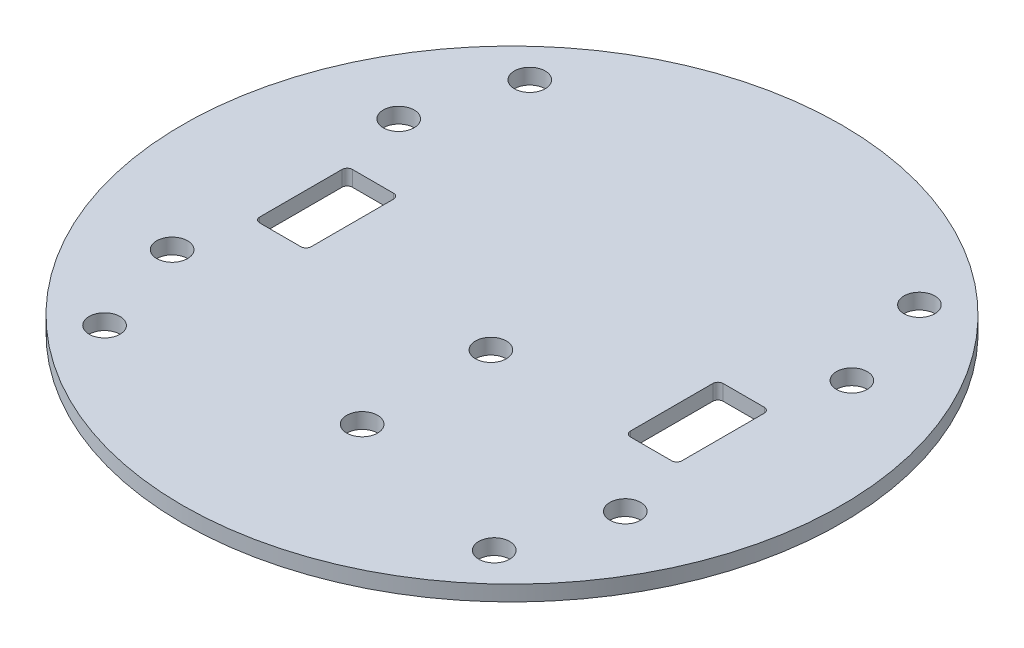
ISO-10303-21;
HEADER;
FILE_DESCRIPTION(('STEP AP214'),'2;1');
FILE_NAME('part.step','',(''),(''),'','','');
FILE_SCHEMA(('AUTOMOTIVE_DESIGN { 1 0 10303 214 1 1 1 1 }'));
ENDSEC;
DATA;
#1=APPLICATION_CONTEXT('core data for automotive mechanical design processes');
#2=APPLICATION_PROTOCOL_DEFINITION('international standard','automotive_design',2000,#1);
#3=PRODUCT_CONTEXT('',#1,'mechanical');
#4=PRODUCT('Part','Part','',(#3));
#5=PRODUCT_RELATED_PRODUCT_CATEGORY('part','',(#4));
#6=PRODUCT_DEFINITION_FORMATION('','',#4);
#7=PRODUCT_DEFINITION_CONTEXT('part definition',#1,'design');
#8=PRODUCT_DEFINITION('design','',#6,#7);
#9=PRODUCT_DEFINITION_SHAPE('','',#8);
#10=(LENGTH_UNIT() NAMED_UNIT(*) SI_UNIT(.MILLI.,.METRE.));
#11=(NAMED_UNIT(*) PLANE_ANGLE_UNIT() SI_UNIT($,.RADIAN.));
#12=(NAMED_UNIT(*) SI_UNIT($,.STERADIAN.) SOLID_ANGLE_UNIT());
#13=UNCERTAINTY_MEASURE_WITH_UNIT(LENGTH_MEASURE(1.E-05),#10,'distance_accuracy_value','');
#14=(GEOMETRIC_REPRESENTATION_CONTEXT(3) GLOBAL_UNCERTAINTY_ASSIGNED_CONTEXT((#13)) GLOBAL_UNIT_ASSIGNED_CONTEXT((#10,
#11,#12)) REPRESENTATION_CONTEXT('',''));
#15=CARTESIAN_POINT('',(0.,0.,0.));
#16=DIRECTION('',(0.,0.,1.));
#17=DIRECTION('',(1.,0.,0.));
#18=AXIS2_PLACEMENT_3D('',#15,#16,#17);
#19=CARTESIAN_POINT('',(0.,-1.5,0.));
#20=DIRECTION('',(0.,1.,0.));
#21=DIRECTION('',(0.,0.,1.));
#22=AXIS2_PLACEMENT_3D('',#19,#20,#21);
#23=CYLINDRICAL_SURFACE('',#22,32.);
#24=CARTESIAN_POINT('',(0.,-1.5,0.));
#25=DIRECTION('',(0.,1.,0.));
#26=DIRECTION('',(0.,0.,1.));
#27=AXIS2_PLACEMENT_3D('',#24,#25,#26);
#28=CIRCLE('',#27,32.);
#29=CARTESIAN_POINT('',(0.,-1.5,32.));
#30=VERTEX_POINT('',#29);
#31=EDGE_CURVE('E299',#30,#30,#28,.T.);
#32=ORIENTED_EDGE('',*,*,#31,.T.);
#33=EDGE_LOOP('',(#32));
#34=FACE_BOUND('',#33,.T.);
#35=CARTESIAN_POINT('',(0.,0.,0.));
#36=DIRECTION('',(0.,1.,0.));
#37=DIRECTION('',(0.,0.,1.));
#38=AXIS2_PLACEMENT_3D('',#35,#36,#37);
#39=CIRCLE('',#38,32.);
#40=CARTESIAN_POINT('',(0.,0.,32.));
#41=VERTEX_POINT('',#40);
#42=EDGE_CURVE('E295',#41,#41,#39,.T.);
#43=ORIENTED_EDGE('',*,*,#42,.F.);
#44=EDGE_LOOP('',(#43));
#45=FACE_BOUND('',#44,.T.);
#46=ADVANCED_FACE('F46',(#34,#45),#23,.T.);
#47=CARTESIAN_POINT('',(0.,-1.5,0.));
#48=DIRECTION('',(0.,1.,0.));
#49=DIRECTION('',(0.,0.,1.));
#50=AXIS2_PLACEMENT_3D('',#47,#48,#49);
#51=PLANE('',#50);
#52=DIRECTION('',(0.,0.,-1.));
#53=VECTOR('',#52,1.);
#54=CARTESIAN_POINT('',(-15.5,-1.5,-4.5));
#55=LINE('',#54,#53);
#56=CARTESIAN_POINT('',(-15.5,-1.5,3.99999999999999));
#57=VERTEX_POINT('',#56);
#58=CARTESIAN_POINT('',(-15.5,-1.5,-4.));
#59=VERTEX_POINT('',#58);
#60=EDGE_CURVE('E414',#57,#59,#55,.T.);
#61=ORIENTED_EDGE('',*,*,#60,.T.);
#62=CARTESIAN_POINT('',(-16.,-1.5,-4.));
#63=DIRECTION('',(0.,1.,0.));
#64=DIRECTION('',(0.,0.,1.));
#65=AXIS2_PLACEMENT_3D('',#62,#63,#64);
#66=CIRCLE('',#65,0.5);
#67=CARTESIAN_POINT('',(-16.,-1.5,-4.5));
#68=VERTEX_POINT('',#67);
#69=EDGE_CURVE('E382',#59,#68,#66,.T.);
#70=ORIENTED_EDGE('',*,*,#69,.T.);
#71=DIRECTION('',(-1.,0.,0.));
#72=VECTOR('',#71,1.);
#73=CARTESIAN_POINT('',(-20.5,-1.5,-4.5));
#74=LINE('',#73,#72);
#75=CARTESIAN_POINT('',(-20.,-1.5,-4.5));
#76=VERTEX_POINT('',#75);
#77=EDGE_CURVE('E222',#68,#76,#74,.T.);
#78=ORIENTED_EDGE('',*,*,#77,.T.);
#79=CARTESIAN_POINT('',(-20.,-1.5,-4.));
#80=DIRECTION('',(0.,1.,0.));
#81=DIRECTION('',(0.,0.,1.));
#82=AXIS2_PLACEMENT_3D('',#79,#80,#81);
#83=CIRCLE('',#82,0.5);
#84=CARTESIAN_POINT('',(-20.5,-1.5,-4.));
#85=VERTEX_POINT('',#84);
#86=EDGE_CURVE('E11',#76,#85,#83,.T.);
#87=ORIENTED_EDGE('',*,*,#86,.T.);
#88=DIRECTION('',(0.,0.,1.));
#89=VECTOR('',#88,1.);
#90=CARTESIAN_POINT('',(-20.5,-1.5,-4.5));
#91=LINE('',#90,#89);
#92=CARTESIAN_POINT('',(-20.5,-1.5,3.99999999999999));
#93=VERTEX_POINT('',#92);
#94=EDGE_CURVE('E404',#85,#93,#91,.T.);
#95=ORIENTED_EDGE('',*,*,#94,.T.);
#96=CARTESIAN_POINT('',(-20.,-1.5,3.99999999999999));
#97=DIRECTION('',(0.,1.,0.));
#98=DIRECTION('',(0.,0.,1.));
#99=AXIS2_PLACEMENT_3D('',#96,#97,#98);
#100=CIRCLE('',#99,0.5);
#101=CARTESIAN_POINT('',(-20.,-1.5,4.5));
#102=VERTEX_POINT('',#101);
#103=EDGE_CURVE('E388',#93,#102,#100,.T.);
#104=ORIENTED_EDGE('',*,*,#103,.T.);
#105=DIRECTION('',(1.,0.,0.));
#106=VECTOR('',#105,1.);
#107=CARTESIAN_POINT('',(-20.5,-1.5,4.5));
#108=LINE('',#107,#106);
#109=CARTESIAN_POINT('',(-16.,-1.5,4.5));
#110=VERTEX_POINT('',#109);
#111=EDGE_CURVE('E410',#102,#110,#108,.T.);
#112=ORIENTED_EDGE('',*,*,#111,.T.);
#113=CARTESIAN_POINT('',(-16.,-1.5,3.99999999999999));
#114=DIRECTION('',(0.,1.,0.));
#115=DIRECTION('',(0.,0.,1.));
#116=AXIS2_PLACEMENT_3D('',#113,#114,#115);
#117=CIRCLE('',#116,0.5);
#118=EDGE_CURVE('E376',#110,#57,#117,.T.);
#119=ORIENTED_EDGE('',*,*,#118,.T.);
#120=EDGE_LOOP('',(#61,#70,#78,#87,#95,#104,#112,#119));
#121=FACE_BOUND('',#120,.T.);
#122=DIRECTION('',(1.,0.,0.));
#123=VECTOR('',#122,1.);
#124=CARTESIAN_POINT('',(20.5,-1.5,4.5));
#125=LINE('',#124,#123);
#126=CARTESIAN_POINT('',(16.,-1.5,4.5));
#127=VERTEX_POINT('',#126);
#128=CARTESIAN_POINT('',(20.,-1.5,4.5));
#129=VERTEX_POINT('',#128);
#130=EDGE_CURVE('E206',#127,#129,#125,.T.);
#131=ORIENTED_EDGE('',*,*,#130,.T.);
#132=CARTESIAN_POINT('',(20.,-1.5,3.99999999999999));
#133=DIRECTION('',(0.,1.,0.));
#134=DIRECTION('',(0.,0.,1.));
#135=AXIS2_PLACEMENT_3D('',#132,#133,#134);
#136=CIRCLE('',#135,0.5);
#137=CARTESIAN_POINT('',(20.5,-1.5,3.99999999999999));
#138=VERTEX_POINT('',#137);
#139=EDGE_CURVE('E370',#129,#138,#136,.T.);
#140=ORIENTED_EDGE('',*,*,#139,.T.);
#141=DIRECTION('',(0.,0.,-1.));
#142=VECTOR('',#141,1.);
#143=CARTESIAN_POINT('',(20.5,-1.5,-4.5));
#144=LINE('',#143,#142);
#145=CARTESIAN_POINT('',(20.5,-1.5,-4.));
#146=VERTEX_POINT('',#145);
#147=EDGE_CURVE('E202',#138,#146,#144,.T.);
#148=ORIENTED_EDGE('',*,*,#147,.T.);
#149=CARTESIAN_POINT('',(20.,-1.5,-4.));
#150=DIRECTION('',(0.,1.,0.));
#151=DIRECTION('',(0.,0.,1.));
#152=AXIS2_PLACEMENT_3D('',#149,#150,#151);
#153=CIRCLE('',#152,0.5);
#154=CARTESIAN_POINT('',(20.,-1.5,-4.5));
#155=VERTEX_POINT('',#154);
#156=EDGE_CURVE('E171',#146,#155,#153,.T.);
#157=ORIENTED_EDGE('',*,*,#156,.T.);
#158=DIRECTION('',(-1.,0.,0.));
#159=VECTOR('',#158,1.);
#160=CARTESIAN_POINT('',(20.5,-1.5,-4.5));
#161=LINE('',#160,#159);
#162=CARTESIAN_POINT('',(16.,-1.5,-4.5));
#163=VERTEX_POINT('',#162);
#164=EDGE_CURVE('E180',#155,#163,#161,.T.);
#165=ORIENTED_EDGE('',*,*,#164,.T.);
#166=CARTESIAN_POINT('',(16.,-1.5,-4.));
#167=DIRECTION('',(0.,1.,0.));
#168=DIRECTION('',(0.,0.,1.));
#169=AXIS2_PLACEMENT_3D('',#166,#167,#168);
#170=CIRCLE('',#169,0.5);
#171=CARTESIAN_POINT('',(15.5,-1.5,-4.));
#172=VERTEX_POINT('',#171);
#173=EDGE_CURVE('E358',#163,#172,#170,.T.);
#174=ORIENTED_EDGE('',*,*,#173,.T.);
#175=DIRECTION('',(0.,0.,1.));
#176=VECTOR('',#175,1.);
#177=CARTESIAN_POINT('',(15.5,-1.5,-4.5));
#178=LINE('',#177,#176);
#179=CARTESIAN_POINT('',(15.5,-1.5,3.99999999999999));
#180=VERTEX_POINT('',#179);
#181=EDGE_CURVE('E210',#172,#180,#178,.T.);
#182=ORIENTED_EDGE('',*,*,#181,.T.);
#183=CARTESIAN_POINT('',(16.,-1.5,3.99999999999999));
#184=DIRECTION('',(0.,1.,0.));
#185=DIRECTION('',(0.,0.,1.));
#186=AXIS2_PLACEMENT_3D('',#183,#184,#185);
#187=CIRCLE('',#186,0.5);
#188=EDGE_CURVE('E364',#180,#127,#187,.T.);
#189=ORIENTED_EDGE('',*,*,#188,.T.);
#190=EDGE_LOOP('',(#131,#140,#148,#157,#165,#174,#182,#189));
#191=FACE_BOUND('',#190,.T.);
#192=CARTESIAN_POINT('',(1.90000000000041,-1.5,3.94999999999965));
#193=DIRECTION('',(0.,1.,0.));
#194=DIRECTION('',(0.,0.,1.));
#195=AXIS2_PLACEMENT_3D('',#192,#193,#194);
#196=CIRCLE('',#195,1.49999999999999);
#197=CARTESIAN_POINT('',(1.90000000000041,-1.5,5.44999999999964));
#198=VERTEX_POINT('',#197);
#199=EDGE_CURVE('E221',#198,#198,#196,.T.);
#200=ORIENTED_EDGE('',*,*,#199,.T.);
#201=EDGE_LOOP('',(#200));
#202=FACE_BOUND('',#201,.T.);
#203=CARTESIAN_POINT('',(1.90000000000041,-1.5,16.4499999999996));
#204=DIRECTION('',(0.,1.,0.));
#205=DIRECTION('',(0.,0.,1.));
#206=AXIS2_PLACEMENT_3D('',#203,#204,#205);
#207=CIRCLE('',#206,1.49999999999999);
#208=CARTESIAN_POINT('',(1.90000000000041,-1.5,17.9499999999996));
#209=VERTEX_POINT('',#208);
#210=EDGE_CURVE('E230',#209,#209,#207,.T.);
#211=ORIENTED_EDGE('',*,*,#210,.T.);
#212=EDGE_LOOP('',(#211));
#213=FACE_BOUND('',#212,.T.);
#214=CARTESIAN_POINT('',(-22.,-1.5,-11.));
#215=DIRECTION('',(0.,1.,0.));
#216=DIRECTION('',(0.,0.,1.));
#217=AXIS2_PLACEMENT_3D('',#214,#215,#216);
#218=CIRCLE('',#217,1.5);
#219=CARTESIAN_POINT('',(-22.,-1.5,-9.50000000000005));
#220=VERTEX_POINT('',#219);
#221=EDGE_CURVE('E238',#220,#220,#218,.T.);
#222=ORIENTED_EDGE('',*,*,#221,.T.);
#223=EDGE_LOOP('',(#222));
#224=FACE_BOUND('',#223,.T.);
#225=CARTESIAN_POINT('',(21.999999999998,-1.5,-11.));
#226=DIRECTION('',(0.,1.,0.));
#227=DIRECTION('',(0.,0.,1.));
#228=AXIS2_PLACEMENT_3D('',#225,#226,#227);
#229=CIRCLE('',#228,1.5);
#230=CARTESIAN_POINT('',(21.999999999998,-1.5,-9.5));
#231=VERTEX_POINT('',#230);
#232=EDGE_CURVE('E246',#231,#231,#229,.T.);
#233=ORIENTED_EDGE('',*,*,#232,.T.);
#234=EDGE_LOOP('',(#233));
#235=FACE_BOUND('',#234,.T.);
#236=CARTESIAN_POINT('',(21.999999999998,-1.5,11.));
#237=DIRECTION('',(0.,1.,0.));
#238=DIRECTION('',(0.,0.,1.));
#239=AXIS2_PLACEMENT_3D('',#236,#237,#238);
#240=CIRCLE('',#239,1.5);
#241=CARTESIAN_POINT('',(21.999999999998,-1.5,12.5));
#242=VERTEX_POINT('',#241);
#243=EDGE_CURVE('E254',#242,#242,#240,.T.);
#244=ORIENTED_EDGE('',*,*,#243,.T.);
#245=EDGE_LOOP('',(#244));
#246=FACE_BOUND('',#245,.T.);
#247=CARTESIAN_POINT('',(-22.,-1.5,11.));
#248=DIRECTION('',(0.,1.,0.));
#249=DIRECTION('',(0.,0.,1.));
#250=AXIS2_PLACEMENT_3D('',#247,#248,#249);
#251=CIRCLE('',#250,1.5);
#252=CARTESIAN_POINT('',(-22.,-1.5,12.4999999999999));
#253=VERTEX_POINT('',#252);
#254=EDGE_CURVE('E262',#253,#253,#251,.T.);
#255=ORIENTED_EDGE('',*,*,#254,.T.);
#256=EDGE_LOOP('',(#255));
#257=FACE_BOUND('',#256,.T.);
#258=CARTESIAN_POINT('',(-18.9165258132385,-1.5,20.6437654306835));
#259=DIRECTION('',(0.,1.,0.));
#260=DIRECTION('',(0.,0.,-1.));
#261=AXIS2_PLACEMENT_3D('',#258,#259,#260);
#262=CIRCLE('',#261,1.5);
#263=CARTESIAN_POINT('',(-18.9165258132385,-1.5,19.1437654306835));
#264=VERTEX_POINT('',#263);
#265=EDGE_CURVE('E266',#264,#264,#262,.T.);
#266=ORIENTED_EDGE('',*,*,#265,.T.);
#267=EDGE_LOOP('',(#266));
#268=FACE_BOUND('',#267,.T.);
#269=CARTESIAN_POINT('',(18.9165258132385,-1.5,20.6437654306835));
#270=DIRECTION('',(0.,1.,0.));
#271=DIRECTION('',(0.,0.,-1.));
#272=AXIS2_PLACEMENT_3D('',#269,#270,#271);
#273=CIRCLE('',#272,1.5);
#274=CARTESIAN_POINT('',(18.9165258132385,-1.5,19.1437654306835));
#275=VERTEX_POINT('',#274);
#276=EDGE_CURVE('E280',#275,#275,#273,.T.);
#277=ORIENTED_EDGE('',*,*,#276,.T.);
#278=EDGE_LOOP('',(#277));
#279=FACE_BOUND('',#278,.T.);
#280=CARTESIAN_POINT('',(18.9165258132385,-1.5,-20.6437654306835));
#281=DIRECTION('',(0.,1.,0.));
#282=DIRECTION('',(0.,0.,1.));
#283=AXIS2_PLACEMENT_3D('',#280,#281,#282);
#284=CIRCLE('',#283,1.5);
#285=CARTESIAN_POINT('',(18.9165258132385,-1.5,-19.1437654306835));
#286=VERTEX_POINT('',#285);
#287=EDGE_CURVE('E272',#286,#286,#284,.T.);
#288=ORIENTED_EDGE('',*,*,#287,.T.);
#289=EDGE_LOOP('',(#288));
#290=FACE_BOUND('',#289,.T.);
#291=CARTESIAN_POINT('',(-18.9165258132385,-1.5,-20.6437654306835));
#292=DIRECTION('',(0.,1.,0.));
#293=DIRECTION('',(0.,0.,1.));
#294=AXIS2_PLACEMENT_3D('',#291,#292,#293);
#295=CIRCLE('',#294,1.5);
#296=CARTESIAN_POINT('',(-18.9165258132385,-1.5,-19.1437654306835));
#297=VERTEX_POINT('',#296);
#298=EDGE_CURVE('E291',#297,#297,#295,.T.);
#299=ORIENTED_EDGE('',*,*,#298,.T.);
#300=EDGE_LOOP('',(#299));
#301=FACE_BOUND('',#300,.T.);
#302=ORIENTED_EDGE('',*,*,#31,.F.);
#303=EDGE_LOOP('',(#302));
#304=FACE_BOUND('',#303,.T.);
#305=ADVANCED_FACE('F443',(#121,#191,#202,#213,#224,#235,#246,#257,#268,#279,#290,#301,#304),
#51,.F.);
#306=CARTESIAN_POINT('',(0.,0.,0.));
#307=DIRECTION('',(0.,1.,0.));
#308=DIRECTION('',(0.,0.,1.));
#309=AXIS2_PLACEMENT_3D('',#306,#307,#308);
#310=PLANE('',#309);
#311=DIRECTION('',(0.,0.,1.));
#312=VECTOR('',#311,1.);
#313=CARTESIAN_POINT('',(-20.5,0.,-4.5));
#314=LINE('',#313,#312);
#315=CARTESIAN_POINT('',(-20.5,0.,-4.));
#316=VERTEX_POINT('',#315);
#317=CARTESIAN_POINT('',(-20.5,0.,3.99999999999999));
#318=VERTEX_POINT('',#317);
#319=EDGE_CURVE('E190',#316,#318,#314,.T.);
#320=ORIENTED_EDGE('',*,*,#319,.F.);
#321=CARTESIAN_POINT('',(-20.,0.,-4.));
#322=DIRECTION('',(0.,1.,0.));
#323=DIRECTION('',(0.,0.,1.));
#324=AXIS2_PLACEMENT_3D('',#321,#322,#323);
#325=CIRCLE('',#324,0.5);
#326=CARTESIAN_POINT('',(-20.,0.,-4.5));
#327=VERTEX_POINT('',#326);
#328=EDGE_CURVE('E55',#316,#327,#325,.F.);
#329=ORIENTED_EDGE('',*,*,#328,.T.);
#330=DIRECTION('',(-1.,0.,0.));
#331=VECTOR('',#330,1.);
#332=CARTESIAN_POINT('',(-20.5,0.,-4.5));
#333=LINE('',#332,#331);
#334=CARTESIAN_POINT('',(-16.,0.,-4.5));
#335=VERTEX_POINT('',#334);
#336=EDGE_CURVE('E395',#335,#327,#333,.T.);
#337=ORIENTED_EDGE('',*,*,#336,.F.);
#338=CARTESIAN_POINT('',(-16.,0.,-4.));
#339=DIRECTION('',(0.,1.,0.));
#340=DIRECTION('',(0.,0.,1.));
#341=AXIS2_PLACEMENT_3D('',#338,#339,#340);
#342=CIRCLE('',#341,0.5);
#343=CARTESIAN_POINT('',(-15.5,0.,-4.));
#344=VERTEX_POINT('',#343);
#345=EDGE_CURVE('E379',#335,#344,#342,.F.);
#346=ORIENTED_EDGE('',*,*,#345,.T.);
#347=DIRECTION('',(0.,0.,-1.));
#348=VECTOR('',#347,1.);
#349=CARTESIAN_POINT('',(-15.5,0.,-4.5));
#350=LINE('',#349,#348);
#351=CARTESIAN_POINT('',(-15.5,0.,3.99999999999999));
#352=VERTEX_POINT('',#351);
#353=EDGE_CURVE('E405',#352,#344,#350,.T.);
#354=ORIENTED_EDGE('',*,*,#353,.F.);
#355=CARTESIAN_POINT('',(-16.,0.,3.99999999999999));
#356=DIRECTION('',(0.,1.,0.));
#357=DIRECTION('',(0.,0.,1.));
#358=AXIS2_PLACEMENT_3D('',#355,#356,#357);
#359=CIRCLE('',#358,0.5);
#360=CARTESIAN_POINT('',(-16.,0.,4.5));
#361=VERTEX_POINT('',#360);
#362=EDGE_CURVE('E373',#352,#361,#359,.F.);
#363=ORIENTED_EDGE('',*,*,#362,.T.);
#364=DIRECTION('',(1.,0.,0.));
#365=VECTOR('',#364,1.);
#366=CARTESIAN_POINT('',(-20.5,0.,4.5));
#367=LINE('',#366,#365);
#368=CARTESIAN_POINT('',(-20.,0.,4.5));
#369=VERTEX_POINT('',#368);
#370=EDGE_CURVE('E195',#369,#361,#367,.T.);
#371=ORIENTED_EDGE('',*,*,#370,.F.);
#372=CARTESIAN_POINT('',(-20.,0.,3.99999999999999));
#373=DIRECTION('',(0.,1.,0.));
#374=DIRECTION('',(0.,0.,1.));
#375=AXIS2_PLACEMENT_3D('',#372,#373,#374);
#376=CIRCLE('',#375,0.5);
#377=EDGE_CURVE('E385',#369,#318,#376,.F.);
#378=ORIENTED_EDGE('',*,*,#377,.T.);
#379=EDGE_LOOP('',(#320,#329,#337,#346,#354,#363,#371,#378));
#380=FACE_BOUND('',#379,.T.);
#381=DIRECTION('',(-1.,0.,0.));
#382=VECTOR('',#381,1.);
#383=CARTESIAN_POINT('',(20.5,0.,-4.5));
#384=LINE('',#383,#382);
#385=CARTESIAN_POINT('',(20.,0.,-4.5));
#386=VERTEX_POINT('',#385);
#387=CARTESIAN_POINT('',(16.,0.,-4.5));
#388=VERTEX_POINT('',#387);
#389=EDGE_CURVE('E177',#386,#388,#384,.T.);
#390=ORIENTED_EDGE('',*,*,#389,.F.);
#391=CARTESIAN_POINT('',(20.,0.,-4.));
#392=DIRECTION('',(0.,1.,0.));
#393=DIRECTION('',(0.,0.,1.));
#394=AXIS2_PLACEMENT_3D('',#391,#392,#393);
#395=CIRCLE('',#394,0.5);
#396=CARTESIAN_POINT('',(20.5,0.,-4.));
#397=VERTEX_POINT('',#396);
#398=EDGE_CURVE('E160',#386,#397,#395,.F.);
#399=ORIENTED_EDGE('',*,*,#398,.T.);
#400=DIRECTION('',(0.,0.,-1.));
#401=VECTOR('',#400,1.);
#402=CARTESIAN_POINT('',(20.5,0.,-4.5));
#403=LINE('',#402,#401);
#404=CARTESIAN_POINT('',(20.5,0.,3.99999999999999));
#405=VERTEX_POINT('',#404);
#406=EDGE_CURVE('E216',#405,#397,#403,.T.);
#407=ORIENTED_EDGE('',*,*,#406,.F.);
#408=CARTESIAN_POINT('',(20.,0.,3.99999999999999));
#409=DIRECTION('',(0.,1.,0.));
#410=DIRECTION('',(0.,0.,1.));
#411=AXIS2_PLACEMENT_3D('',#408,#409,#410);
#412=CIRCLE('',#411,0.5);
#413=CARTESIAN_POINT('',(20.,0.,4.5));
#414=VERTEX_POINT('',#413);
#415=EDGE_CURVE('E367',#405,#414,#412,.F.);
#416=ORIENTED_EDGE('',*,*,#415,.T.);
#417=DIRECTION('',(1.,0.,0.));
#418=VECTOR('',#417,1.);
#419=CARTESIAN_POINT('',(20.5,0.,4.5));
#420=LINE('',#419,#418);
#421=CARTESIAN_POINT('',(16.,0.,4.5));
#422=VERTEX_POINT('',#421);
#423=EDGE_CURVE('E198',#422,#414,#420,.T.);
#424=ORIENTED_EDGE('',*,*,#423,.F.);
#425=CARTESIAN_POINT('',(16.,0.,3.99999999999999));
#426=DIRECTION('',(0.,1.,0.));
#427=DIRECTION('',(0.,0.,1.));
#428=AXIS2_PLACEMENT_3D('',#425,#426,#427);
#429=CIRCLE('',#428,0.5);
#430=CARTESIAN_POINT('',(15.5,0.,3.99999999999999));
#431=VERTEX_POINT('',#430);
#432=EDGE_CURVE('E361',#422,#431,#429,.F.);
#433=ORIENTED_EDGE('',*,*,#432,.T.);
#434=DIRECTION('',(0.,0.,1.));
#435=VECTOR('',#434,1.);
#436=CARTESIAN_POINT('',(15.5,0.,-4.5));
#437=LINE('',#436,#435);
#438=CARTESIAN_POINT('',(15.5,0.,-4.));
#439=VERTEX_POINT('',#438);
#440=EDGE_CURVE('E191',#439,#431,#437,.T.);
#441=ORIENTED_EDGE('',*,*,#440,.F.);
#442=CARTESIAN_POINT('',(16.,0.,-4.));
#443=DIRECTION('',(0.,1.,0.));
#444=DIRECTION('',(0.,0.,1.));
#445=AXIS2_PLACEMENT_3D('',#442,#443,#444);
#446=CIRCLE('',#445,0.5);
#447=EDGE_CURVE('E188',#439,#388,#446,.F.);
#448=ORIENTED_EDGE('',*,*,#447,.T.);
#449=EDGE_LOOP('',(#390,#399,#407,#416,#424,#433,#441,#448));
#450=FACE_BOUND('',#449,.T.);
#451=CARTESIAN_POINT('',(1.90000000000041,0.,3.94999999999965));
#452=DIRECTION('',(0.,1.,0.));
#453=DIRECTION('',(0.,0.,1.));
#454=AXIS2_PLACEMENT_3D('',#451,#452,#453);
#455=CIRCLE('',#454,1.49999999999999);
#456=CARTESIAN_POINT('',(1.90000000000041,0.,5.44999999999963));
#457=VERTEX_POINT('',#456);
#458=EDGE_CURVE('E217',#457,#457,#455,.T.);
#459=ORIENTED_EDGE('',*,*,#458,.F.);
#460=EDGE_LOOP('',(#459));
#461=FACE_BOUND('',#460,.T.);
#462=CARTESIAN_POINT('',(1.90000000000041,0.,16.4499999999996));
#463=DIRECTION('',(0.,1.,0.));
#464=DIRECTION('',(0.,0.,1.));
#465=AXIS2_PLACEMENT_3D('',#462,#463,#464);
#466=CIRCLE('',#465,1.49999999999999);
#467=CARTESIAN_POINT('',(1.90000000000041,0.,17.9499999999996));
#468=VERTEX_POINT('',#467);
#469=EDGE_CURVE('E226',#468,#468,#466,.T.);
#470=ORIENTED_EDGE('',*,*,#469,.F.);
#471=EDGE_LOOP('',(#470));
#472=FACE_BOUND('',#471,.T.);
#473=CARTESIAN_POINT('',(-22.,0.,-11.));
#474=DIRECTION('',(0.,1.,0.));
#475=DIRECTION('',(0.,0.,1.));
#476=AXIS2_PLACEMENT_3D('',#473,#474,#475);
#477=CIRCLE('',#476,1.49999999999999);
#478=CARTESIAN_POINT('',(-22.,0.,-9.50000000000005));
#479=VERTEX_POINT('',#478);
#480=EDGE_CURVE('E234',#479,#479,#477,.T.);
#481=ORIENTED_EDGE('',*,*,#480,.F.);
#482=EDGE_LOOP('',(#481));
#483=FACE_BOUND('',#482,.T.);
#484=CARTESIAN_POINT('',(21.999999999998,0.,-11.));
#485=DIRECTION('',(0.,1.,0.));
#486=DIRECTION('',(0.,0.,1.));
#487=AXIS2_PLACEMENT_3D('',#484,#485,#486);
#488=CIRCLE('',#487,1.49999999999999);
#489=CARTESIAN_POINT('',(21.999999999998,0.,-9.50000000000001));
#490=VERTEX_POINT('',#489);
#491=EDGE_CURVE('E242',#490,#490,#488,.T.);
#492=ORIENTED_EDGE('',*,*,#491,.F.);
#493=EDGE_LOOP('',(#492));
#494=FACE_BOUND('',#493,.T.);
#495=CARTESIAN_POINT('',(21.999999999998,0.,11.));
#496=DIRECTION('',(0.,1.,0.));
#497=DIRECTION('',(0.,0.,1.));
#498=AXIS2_PLACEMENT_3D('',#495,#496,#497);
#499=CIRCLE('',#498,1.49999999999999);
#500=CARTESIAN_POINT('',(21.999999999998,0.,12.5));
#501=VERTEX_POINT('',#500);
#502=EDGE_CURVE('E250',#501,#501,#499,.T.);
#503=ORIENTED_EDGE('',*,*,#502,.F.);
#504=EDGE_LOOP('',(#503));
#505=FACE_BOUND('',#504,.T.);
#506=CARTESIAN_POINT('',(-22.,0.,11.));
#507=DIRECTION('',(0.,1.,0.));
#508=DIRECTION('',(0.,0.,1.));
#509=AXIS2_PLACEMENT_3D('',#506,#507,#508);
#510=CIRCLE('',#509,1.49999999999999);
#511=CARTESIAN_POINT('',(-22.,0.,12.4999999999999));
#512=VERTEX_POINT('',#511);
#513=EDGE_CURVE('E258',#512,#512,#510,.T.);
#514=ORIENTED_EDGE('',*,*,#513,.F.);
#515=EDGE_LOOP('',(#514));
#516=FACE_BOUND('',#515,.T.);
#517=CARTESIAN_POINT('',(-18.9165258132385,0.,20.6437654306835));
#518=DIRECTION('',(0.,1.,0.));
#519=DIRECTION('',(0.,0.,-1.));
#520=AXIS2_PLACEMENT_3D('',#517,#518,#519);
#521=CIRCLE('',#520,1.5);
#522=CARTESIAN_POINT('',(-18.9165258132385,0.,19.1437654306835));
#523=VERTEX_POINT('',#522);
#524=EDGE_CURVE('E284',#523,#523,#521,.T.);
#525=ORIENTED_EDGE('',*,*,#524,.F.);
#526=EDGE_LOOP('',(#525));
#527=FACE_BOUND('',#526,.T.);
#528=CARTESIAN_POINT('',(18.9165258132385,0.,20.6437654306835));
#529=DIRECTION('',(0.,1.,0.));
#530=DIRECTION('',(0.,0.,-1.));
#531=AXIS2_PLACEMENT_3D('',#528,#529,#530);
#532=CIRCLE('',#531,1.5);
#533=CARTESIAN_POINT('',(18.9165258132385,0.,19.1437654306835));
#534=VERTEX_POINT('',#533);
#535=EDGE_CURVE('E276',#534,#534,#532,.T.);
#536=ORIENTED_EDGE('',*,*,#535,.F.);
#537=EDGE_LOOP('',(#536));
#538=FACE_BOUND('',#537,.T.);
#539=CARTESIAN_POINT('',(18.9165258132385,0.,-20.6437654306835));
#540=DIRECTION('',(0.,1.,0.));
#541=DIRECTION('',(0.,0.,1.));
#542=AXIS2_PLACEMENT_3D('',#539,#540,#541);
#543=CIRCLE('',#542,1.5);
#544=CARTESIAN_POINT('',(18.9165258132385,0.,-19.1437654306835));
#545=VERTEX_POINT('',#544);
#546=EDGE_CURVE('E267',#545,#545,#543,.T.);
#547=ORIENTED_EDGE('',*,*,#546,.F.);
#548=EDGE_LOOP('',(#547));
#549=FACE_BOUND('',#548,.T.);
#550=CARTESIAN_POINT('',(-18.9165258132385,0.,-20.6437654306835));
#551=DIRECTION('',(0.,1.,0.));
#552=DIRECTION('',(0.,0.,1.));
#553=AXIS2_PLACEMENT_3D('',#550,#551,#552);
#554=CIRCLE('',#553,1.5);
#555=CARTESIAN_POINT('',(-18.9165258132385,0.,-19.1437654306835));
#556=VERTEX_POINT('',#555);
#557=EDGE_CURVE('E271',#556,#556,#554,.T.);
#558=ORIENTED_EDGE('',*,*,#557,.F.);
#559=EDGE_LOOP('',(#558));
#560=FACE_BOUND('',#559,.T.);
#561=ORIENTED_EDGE('',*,*,#42,.T.);
#562=EDGE_LOOP('',(#561));
#563=FACE_BOUND('',#562,.T.);
#564=ADVANCED_FACE('F185',(#380,#450,#461,#472,#483,#494,#505,#516,#527,#538,#549,#560,#563),
#310,.T.);
#565=CARTESIAN_POINT('',(-18.9165258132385,-1.5,-20.6437654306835));
#566=DIRECTION('',(0.,1.,0.));
#567=DIRECTION('',(0.,0.,1.));
#568=AXIS2_PLACEMENT_3D('',#565,#566,#567);
#569=CYLINDRICAL_SURFACE('',#568,1.5);
#570=ORIENTED_EDGE('',*,*,#298,.F.);
#571=EDGE_LOOP('',(#570));
#572=FACE_BOUND('',#571,.T.);
#573=ORIENTED_EDGE('',*,*,#557,.T.);
#574=EDGE_LOOP('',(#573));
#575=FACE_BOUND('',#574,.T.);
#576=ADVANCED_FACE('F748',(#572,#575),#569,.F.);
#577=CARTESIAN_POINT('',(18.9165258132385,-1.5,-20.6437654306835));
#578=DIRECTION('',(0.,1.,0.));
#579=DIRECTION('',(0.,0.,1.));
#580=AXIS2_PLACEMENT_3D('',#577,#578,#579);
#581=CYLINDRICAL_SURFACE('',#580,1.5);
#582=ORIENTED_EDGE('',*,*,#287,.F.);
#583=EDGE_LOOP('',(#582));
#584=FACE_BOUND('',#583,.T.);
#585=ORIENTED_EDGE('',*,*,#546,.T.);
#586=EDGE_LOOP('',(#585));
#587=FACE_BOUND('',#586,.T.);
#588=ADVANCED_FACE('F736',(#584,#587),#581,.F.);
#589=CARTESIAN_POINT('',(18.9165258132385,-1.5,20.6437654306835));
#590=DIRECTION('',(0.,1.,0.));
#591=DIRECTION('',(0.,0.,1.));
#592=AXIS2_PLACEMENT_3D('',#589,#590,#591);
#593=CYLINDRICAL_SURFACE('',#592,1.5);
#594=ORIENTED_EDGE('',*,*,#276,.F.);
#595=EDGE_LOOP('',(#594));
#596=FACE_BOUND('',#595,.T.);
#597=ORIENTED_EDGE('',*,*,#535,.T.);
#598=EDGE_LOOP('',(#597));
#599=FACE_BOUND('',#598,.T.);
#600=ADVANCED_FACE('F724',(#596,#599),#593,.F.);
#601=CARTESIAN_POINT('',(-18.9165258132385,-1.5,20.6437654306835));
#602=DIRECTION('',(0.,1.,0.));
#603=DIRECTION('',(0.,0.,1.));
#604=AXIS2_PLACEMENT_3D('',#601,#602,#603);
#605=CYLINDRICAL_SURFACE('',#604,1.5);
#606=ORIENTED_EDGE('',*,*,#265,.F.);
#607=EDGE_LOOP('',(#606));
#608=FACE_BOUND('',#607,.T.);
#609=ORIENTED_EDGE('',*,*,#524,.T.);
#610=EDGE_LOOP('',(#609));
#611=FACE_BOUND('',#610,.T.);
#612=ADVANCED_FACE('F714',(#608,#611),#605,.F.);
#613=CARTESIAN_POINT('',(-22.,0.,11.));
#614=DIRECTION('',(0.,1.,0.));
#615=DIRECTION('',(0.,0.,1.));
#616=AXIS2_PLACEMENT_3D('',#613,#614,#615);
#617=CYLINDRICAL_SURFACE('',#616,1.5);
#618=ORIENTED_EDGE('',*,*,#254,.F.);
#619=EDGE_LOOP('',(#618));
#620=FACE_BOUND('',#619,.T.);
#621=ORIENTED_EDGE('',*,*,#513,.T.);
#622=EDGE_LOOP('',(#621));
#623=FACE_BOUND('',#622,.T.);
#624=ADVANCED_FACE('F704',(#620,#623),#617,.F.);
#625=CARTESIAN_POINT('',(21.999999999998,0.,11.));
#626=DIRECTION('',(0.,1.,0.));
#627=DIRECTION('',(0.,0.,1.));
#628=AXIS2_PLACEMENT_3D('',#625,#626,#627);
#629=CYLINDRICAL_SURFACE('',#628,1.5);
#630=ORIENTED_EDGE('',*,*,#243,.F.);
#631=EDGE_LOOP('',(#630));
#632=FACE_BOUND('',#631,.T.);
#633=ORIENTED_EDGE('',*,*,#502,.T.);
#634=EDGE_LOOP('',(#633));
#635=FACE_BOUND('',#634,.T.);
#636=ADVANCED_FACE('F694',(#632,#635),#629,.F.);
#637=CARTESIAN_POINT('',(21.999999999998,0.,-11.));
#638=DIRECTION('',(0.,1.,0.));
#639=DIRECTION('',(0.,0.,1.));
#640=AXIS2_PLACEMENT_3D('',#637,#638,#639);
#641=CYLINDRICAL_SURFACE('',#640,1.5);
#642=ORIENTED_EDGE('',*,*,#232,.F.);
#643=EDGE_LOOP('',(#642));
#644=FACE_BOUND('',#643,.T.);
#645=ORIENTED_EDGE('',*,*,#491,.T.);
#646=EDGE_LOOP('',(#645));
#647=FACE_BOUND('',#646,.T.);
#648=ADVANCED_FACE('F684',(#644,#647),#641,.F.);
#649=CARTESIAN_POINT('',(-22.,0.,-11.));
#650=DIRECTION('',(0.,1.,0.));
#651=DIRECTION('',(0.,0.,1.));
#652=AXIS2_PLACEMENT_3D('',#649,#650,#651);
#653=CYLINDRICAL_SURFACE('',#652,1.5);
#654=ORIENTED_EDGE('',*,*,#221,.F.);
#655=EDGE_LOOP('',(#654));
#656=FACE_BOUND('',#655,.T.);
#657=ORIENTED_EDGE('',*,*,#480,.T.);
#658=EDGE_LOOP('',(#657));
#659=FACE_BOUND('',#658,.T.);
#660=ADVANCED_FACE('F674',(#656,#659),#653,.F.);
#661=CARTESIAN_POINT('',(1.90000000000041,0.,16.4499999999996));
#662=DIRECTION('',(0.,1.,0.));
#663=DIRECTION('',(0.,0.,1.));
#664=AXIS2_PLACEMENT_3D('',#661,#662,#663);
#665=CYLINDRICAL_SURFACE('',#664,1.49999999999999);
#666=ORIENTED_EDGE('',*,*,#210,.F.);
#667=EDGE_LOOP('',(#666));
#668=FACE_BOUND('',#667,.T.);
#669=ORIENTED_EDGE('',*,*,#469,.T.);
#670=EDGE_LOOP('',(#669));
#671=FACE_BOUND('',#670,.T.);
#672=ADVANCED_FACE('F665',(#668,#671),#665,.F.);
#673=CARTESIAN_POINT('',(1.90000000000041,0.,3.94999999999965));
#674=DIRECTION('',(0.,1.,0.));
#675=DIRECTION('',(0.,0.,1.));
#676=AXIS2_PLACEMENT_3D('',#673,#674,#675);
#677=CYLINDRICAL_SURFACE('',#676,1.49999999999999);
#678=ORIENTED_EDGE('',*,*,#199,.F.);
#679=EDGE_LOOP('',(#678));
#680=FACE_BOUND('',#679,.T.);
#681=ORIENTED_EDGE('',*,*,#458,.T.);
#682=EDGE_LOOP('',(#681));
#683=FACE_BOUND('',#682,.T.);
#684=ADVANCED_FACE('F455',(#680,#683),#677,.F.);
#685=CARTESIAN_POINT('',(20.5,-1.5,-4.5));
#686=DIRECTION('',(0.,0.,-1.));
#687=DIRECTION('',(-1.,0.,0.));
#688=AXIS2_PLACEMENT_3D('',#685,#686,#687);
#689=PLANE('',#688);
#690=ORIENTED_EDGE('',*,*,#164,.F.);
#691=DIRECTION('',(0.,1.,0.));
#692=VECTOR('',#691,1.);
#693=CARTESIAN_POINT('',(20.,0.,-4.5));
#694=LINE('',#693,#692);
#695=EDGE_CURVE('E164',#155,#386,#694,.T.);
#696=ORIENTED_EDGE('',*,*,#695,.T.);
#697=ORIENTED_EDGE('',*,*,#389,.T.);
#698=DIRECTION('',(0.,1.,0.));
#699=VECTOR('',#698,1.);
#700=CARTESIAN_POINT('',(16.,-1.5,-4.5));
#701=LINE('',#700,#699);
#702=EDGE_CURVE('E183',#388,#163,#701,.F.);
#703=ORIENTED_EDGE('',*,*,#702,.T.);
#704=EDGE_LOOP('',(#690,#696,#697,#703));
#705=FACE_BOUND('',#704,.T.);
#706=ADVANCED_FACE('F176',(#705),#689,.F.);
#707=CARTESIAN_POINT('',(20.5,-1.5,-4.5));
#708=DIRECTION('',(1.,0.,0.));
#709=DIRECTION('',(0.,0.,-1.));
#710=AXIS2_PLACEMENT_3D('',#707,#708,#709);
#711=PLANE('',#710);
#712=ORIENTED_EDGE('',*,*,#406,.T.);
#713=DIRECTION('',(0.,1.,0.));
#714=VECTOR('',#713,1.);
#715=CARTESIAN_POINT('',(20.5,-1.5,-4.));
#716=LINE('',#715,#714);
#717=EDGE_CURVE('E165',#397,#146,#716,.F.);
#718=ORIENTED_EDGE('',*,*,#717,.T.);
#719=ORIENTED_EDGE('',*,*,#147,.F.);
#720=DIRECTION('',(0.,1.,0.));
#721=VECTOR('',#720,1.);
#722=CARTESIAN_POINT('',(20.5,0.,3.99999999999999));
#723=LINE('',#722,#721);
#724=EDGE_CURVE('E182',#138,#405,#723,.T.);
#725=ORIENTED_EDGE('',*,*,#724,.T.);
#726=EDGE_LOOP('',(#712,#718,#719,#725));
#727=FACE_BOUND('',#726,.T.);
#728=ADVANCED_FACE('F446',(#727),#711,.F.);
#729=CARTESIAN_POINT('',(20.5,-1.5,4.5));
#730=DIRECTION('',(0.,0.,1.));
#731=DIRECTION('',(1.,0.,0.));
#732=AXIS2_PLACEMENT_3D('',#729,#730,#731);
#733=PLANE('',#732);
#734=ORIENTED_EDGE('',*,*,#130,.F.);
#735=DIRECTION('',(0.,1.,0.));
#736=VECTOR('',#735,1.);
#737=CARTESIAN_POINT('',(16.,0.,4.5));
#738=LINE('',#737,#736);
#739=EDGE_CURVE('E323',#127,#422,#738,.T.);
#740=ORIENTED_EDGE('',*,*,#739,.T.);
#741=ORIENTED_EDGE('',*,*,#423,.T.);
#742=DIRECTION('',(0.,1.,0.));
#743=VECTOR('',#742,1.);
#744=CARTESIAN_POINT('',(20.,-1.5,4.5));
#745=LINE('',#744,#743);
#746=EDGE_CURVE('E320',#414,#129,#745,.F.);
#747=ORIENTED_EDGE('',*,*,#746,.T.);
#748=EDGE_LOOP('',(#734,#740,#741,#747));
#749=FACE_BOUND('',#748,.T.);
#750=ADVANCED_FACE('F435',(#749),#733,.F.);
#751=CARTESIAN_POINT('',(15.5,-1.5,-4.5));
#752=DIRECTION('',(-1.,0.,0.));
#753=DIRECTION('',(0.,0.,1.));
#754=AXIS2_PLACEMENT_3D('',#751,#752,#753);
#755=PLANE('',#754);
#756=ORIENTED_EDGE('',*,*,#181,.F.);
#757=DIRECTION('',(0.,1.,0.));
#758=VECTOR('',#757,1.);
#759=CARTESIAN_POINT('',(15.5,0.,-4.));
#760=LINE('',#759,#758);
#761=EDGE_CURVE('E316',#172,#439,#760,.T.);
#762=ORIENTED_EDGE('',*,*,#761,.T.);
#763=ORIENTED_EDGE('',*,*,#440,.T.);
#764=DIRECTION('',(0.,1.,0.));
#765=VECTOR('',#764,1.);
#766=CARTESIAN_POINT('',(15.5,-1.5,3.99999999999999));
#767=LINE('',#766,#765);
#768=EDGE_CURVE('E313',#431,#180,#767,.F.);
#769=ORIENTED_EDGE('',*,*,#768,.T.);
#770=EDGE_LOOP('',(#756,#762,#763,#769));
#771=FACE_BOUND('',#770,.T.);
#772=ADVANCED_FACE('F453',(#771),#755,.F.);
#773=CARTESIAN_POINT('',(-20.5,-1.5,-4.5));
#774=DIRECTION('',(-1.,0.,0.));
#775=DIRECTION('',(0.,0.,1.));
#776=AXIS2_PLACEMENT_3D('',#773,#774,#775);
#777=PLANE('',#776);
#778=ORIENTED_EDGE('',*,*,#319,.T.);
#779=DIRECTION('',(0.,1.,0.));
#780=VECTOR('',#779,1.);
#781=CARTESIAN_POINT('',(-20.5,-1.5,3.99999999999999));
#782=LINE('',#781,#780);
#783=EDGE_CURVE('E62',#318,#93,#782,.F.);
#784=ORIENTED_EDGE('',*,*,#783,.T.);
#785=ORIENTED_EDGE('',*,*,#94,.F.);
#786=DIRECTION('',(0.,1.,0.));
#787=VECTOR('',#786,1.);
#788=CARTESIAN_POINT('',(-20.5,0.,-4.));
#789=LINE('',#788,#787);
#790=EDGE_CURVE('E348',#85,#316,#789,.T.);
#791=ORIENTED_EDGE('',*,*,#790,.T.);
#792=EDGE_LOOP('',(#778,#784,#785,#791));
#793=FACE_BOUND('',#792,.T.);
#794=ADVANCED_FACE('F407',(#793),#777,.F.);
#795=CARTESIAN_POINT('',(-20.5,-1.5,-4.5));
#796=DIRECTION('',(0.,0.,-1.));
#797=DIRECTION('',(-1.,0.,0.));
#798=AXIS2_PLACEMENT_3D('',#795,#796,#797);
#799=PLANE('',#798);
#800=ORIENTED_EDGE('',*,*,#77,.F.);
#801=DIRECTION('',(0.,1.,0.));
#802=VECTOR('',#801,1.);
#803=CARTESIAN_POINT('',(-16.,0.,-4.5));
#804=LINE('',#803,#802);
#805=EDGE_CURVE('E344',#68,#335,#804,.T.);
#806=ORIENTED_EDGE('',*,*,#805,.T.);
#807=ORIENTED_EDGE('',*,*,#336,.T.);
#808=DIRECTION('',(0.,1.,0.));
#809=VECTOR('',#808,1.);
#810=CARTESIAN_POINT('',(-20.,-1.5,-4.5));
#811=LINE('',#810,#809);
#812=EDGE_CURVE('E341',#327,#76,#811,.F.);
#813=ORIENTED_EDGE('',*,*,#812,.T.);
#814=EDGE_LOOP('',(#800,#806,#807,#813));
#815=FACE_BOUND('',#814,.T.);
#816=ADVANCED_FACE('F401',(#815),#799,.F.);
#817=CARTESIAN_POINT('',(-15.5,-1.5,-4.5));
#818=DIRECTION('',(1.,0.,0.));
#819=DIRECTION('',(0.,0.,-1.));
#820=AXIS2_PLACEMENT_3D('',#817,#818,#819);
#821=PLANE('',#820);
#822=ORIENTED_EDGE('',*,*,#60,.F.);
#823=DIRECTION('',(0.,1.,0.));
#824=VECTOR('',#823,1.);
#825=CARTESIAN_POINT('',(-15.5,0.,3.99999999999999));
#826=LINE('',#825,#824);
#827=EDGE_CURVE('E330',#57,#352,#826,.T.);
#828=ORIENTED_EDGE('',*,*,#827,.T.);
#829=ORIENTED_EDGE('',*,*,#353,.T.);
#830=DIRECTION('',(0.,1.,0.));
#831=VECTOR('',#830,1.);
#832=CARTESIAN_POINT('',(-15.5,-1.5,-4.));
#833=LINE('',#832,#831);
#834=EDGE_CURVE('E327',#344,#59,#833,.F.);
#835=ORIENTED_EDGE('',*,*,#834,.T.);
#836=EDGE_LOOP('',(#822,#828,#829,#835));
#837=FACE_BOUND('',#836,.T.);
#838=ADVANCED_FACE('F504',(#837),#821,.F.);
#839=CARTESIAN_POINT('',(-20.5,-1.5,4.5));
#840=DIRECTION('',(0.,0.,1.));
#841=DIRECTION('',(1.,0.,0.));
#842=AXIS2_PLACEMENT_3D('',#839,#840,#841);
#843=PLANE('',#842);
#844=ORIENTED_EDGE('',*,*,#370,.T.);
#845=DIRECTION('',(0.,1.,0.));
#846=VECTOR('',#845,1.);
#847=CARTESIAN_POINT('',(-16.,-1.5,4.5));
#848=LINE('',#847,#846);
#849=EDGE_CURVE('E338',#361,#110,#848,.F.);
#850=ORIENTED_EDGE('',*,*,#849,.T.);
#851=ORIENTED_EDGE('',*,*,#111,.F.);
#852=DIRECTION('',(0.,1.,0.));
#853=VECTOR('',#852,1.);
#854=CARTESIAN_POINT('',(-20.,0.,4.5));
#855=LINE('',#854,#853);
#856=EDGE_CURVE('E334',#102,#369,#855,.T.);
#857=ORIENTED_EDGE('',*,*,#856,.T.);
#858=EDGE_LOOP('',(#844,#850,#851,#857));
#859=FACE_BOUND('',#858,.T.);
#860=ADVANCED_FACE('F471',(#859),#843,.F.);
#861=CARTESIAN_POINT('',(20.,-1.5,-4.));
#862=DIRECTION('',(0.,-1.,0.));
#863=DIRECTION('',(0.,0.,-1.));
#864=AXIS2_PLACEMENT_3D('',#861,#862,#863);
#865=CYLINDRICAL_SURFACE('',#864,0.5);
#866=ORIENTED_EDGE('',*,*,#156,.F.);
#867=ORIENTED_EDGE('',*,*,#717,.F.);
#868=ORIENTED_EDGE('',*,*,#398,.F.);
#869=ORIENTED_EDGE('',*,*,#695,.F.);
#870=EDGE_LOOP('',(#866,#867,#868,#869));
#871=FACE_BOUND('',#870,.T.);
#872=ADVANCED_FACE('F163',(#871),#865,.F.);
#873=CARTESIAN_POINT('',(16.,-1.5,-4.));
#874=DIRECTION('',(0.,-1.,0.));
#875=DIRECTION('',(0.,0.,-1.));
#876=AXIS2_PLACEMENT_3D('',#873,#874,#875);
#877=CYLINDRICAL_SURFACE('',#876,0.5);
#878=ORIENTED_EDGE('',*,*,#173,.F.);
#879=ORIENTED_EDGE('',*,*,#702,.F.);
#880=ORIENTED_EDGE('',*,*,#447,.F.);
#881=ORIENTED_EDGE('',*,*,#761,.F.);
#882=EDGE_LOOP('',(#878,#879,#880,#881));
#883=FACE_BOUND('',#882,.T.);
#884=ADVANCED_FACE('F470',(#883),#877,.F.);
#885=CARTESIAN_POINT('',(16.,-1.5,3.99999999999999));
#886=DIRECTION('',(0.,-1.,0.));
#887=DIRECTION('',(0.,0.,-1.));
#888=AXIS2_PLACEMENT_3D('',#885,#886,#887);
#889=CYLINDRICAL_SURFACE('',#888,0.5);
#890=ORIENTED_EDGE('',*,*,#188,.F.);
#891=ORIENTED_EDGE('',*,*,#768,.F.);
#892=ORIENTED_EDGE('',*,*,#432,.F.);
#893=ORIENTED_EDGE('',*,*,#739,.F.);
#894=EDGE_LOOP('',(#890,#891,#892,#893));
#895=FACE_BOUND('',#894,.T.);
#896=ADVANCED_FACE('F474',(#895),#889,.F.);
#897=CARTESIAN_POINT('',(20.,-1.5,3.99999999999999));
#898=DIRECTION('',(0.,-1.,0.));
#899=DIRECTION('',(0.,0.,-1.));
#900=AXIS2_PLACEMENT_3D('',#897,#898,#899);
#901=CYLINDRICAL_SURFACE('',#900,0.5);
#902=ORIENTED_EDGE('',*,*,#139,.F.);
#903=ORIENTED_EDGE('',*,*,#746,.F.);
#904=ORIENTED_EDGE('',*,*,#415,.F.);
#905=ORIENTED_EDGE('',*,*,#724,.F.);
#906=EDGE_LOOP('',(#902,#903,#904,#905));
#907=FACE_BOUND('',#906,.T.);
#908=ADVANCED_FACE('F439',(#907),#901,.F.);
#909=CARTESIAN_POINT('',(-16.,-1.5,3.99999999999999));
#910=DIRECTION('',(0.,-1.,0.));
#911=DIRECTION('',(0.,0.,-1.));
#912=AXIS2_PLACEMENT_3D('',#909,#910,#911);
#913=CYLINDRICAL_SURFACE('',#912,0.5);
#914=ORIENTED_EDGE('',*,*,#118,.F.);
#915=ORIENTED_EDGE('',*,*,#849,.F.);
#916=ORIENTED_EDGE('',*,*,#362,.F.);
#917=ORIENTED_EDGE('',*,*,#827,.F.);
#918=EDGE_LOOP('',(#914,#915,#916,#917));
#919=FACE_BOUND('',#918,.T.);
#920=ADVANCED_FACE('F481',(#919),#913,.F.);
#921=CARTESIAN_POINT('',(-16.,-1.5,-4.));
#922=DIRECTION('',(0.,-1.,0.));
#923=DIRECTION('',(0.,0.,-1.));
#924=AXIS2_PLACEMENT_3D('',#921,#922,#923);
#925=CYLINDRICAL_SURFACE('',#924,0.5);
#926=ORIENTED_EDGE('',*,*,#69,.F.);
#927=ORIENTED_EDGE('',*,*,#834,.F.);
#928=ORIENTED_EDGE('',*,*,#345,.F.);
#929=ORIENTED_EDGE('',*,*,#805,.F.);
#930=EDGE_LOOP('',(#926,#927,#928,#929));
#931=FACE_BOUND('',#930,.T.);
#932=ADVANCED_FACE('F484',(#931),#925,.F.);
#933=CARTESIAN_POINT('',(-20.,-1.5,3.99999999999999));
#934=DIRECTION('',(0.,-1.,0.));
#935=DIRECTION('',(0.,0.,-1.));
#936=AXIS2_PLACEMENT_3D('',#933,#934,#935);
#937=CYLINDRICAL_SURFACE('',#936,0.5);
#938=ORIENTED_EDGE('',*,*,#103,.F.);
#939=ORIENTED_EDGE('',*,*,#783,.F.);
#940=ORIENTED_EDGE('',*,*,#377,.F.);
#941=ORIENTED_EDGE('',*,*,#856,.F.);
#942=EDGE_LOOP('',(#938,#939,#940,#941));
#943=FACE_BOUND('',#942,.T.);
#944=ADVANCED_FACE('F487',(#943),#937,.F.);
#945=CARTESIAN_POINT('',(-20.,-1.5,-4.));
#946=DIRECTION('',(0.,-1.,0.));
#947=DIRECTION('',(0.,0.,-1.));
#948=AXIS2_PLACEMENT_3D('',#945,#946,#947);
#949=CYLINDRICAL_SURFACE('',#948,0.5);
#950=ORIENTED_EDGE('',*,*,#86,.F.);
#951=ORIENTED_EDGE('',*,*,#812,.F.);
#952=ORIENTED_EDGE('',*,*,#328,.F.);
#953=ORIENTED_EDGE('',*,*,#790,.F.);
#954=EDGE_LOOP('',(#950,#951,#952,#953));
#955=FACE_BOUND('',#954,.T.);
#956=ADVANCED_FACE('F48',(#955),#949,.F.);
#957=CLOSED_SHELL('',(#46,#305,#564,#576,#588,#600,#612,#624,#636,#648,#660,#672,#684,#706,#728,
#750,#772,#794,#816,#838,#860,#872,#884,#896,#908,#920,#932,#944,#956));
#958=MANIFOLD_SOLID_BREP('B2',#957);
#959=ADVANCED_BREP_SHAPE_REPRESENTATION('',(#18,#958),#14);
#960=SHAPE_DEFINITION_REPRESENTATION(#9,#959);
ENDSEC;
END-ISO-10303-21;
